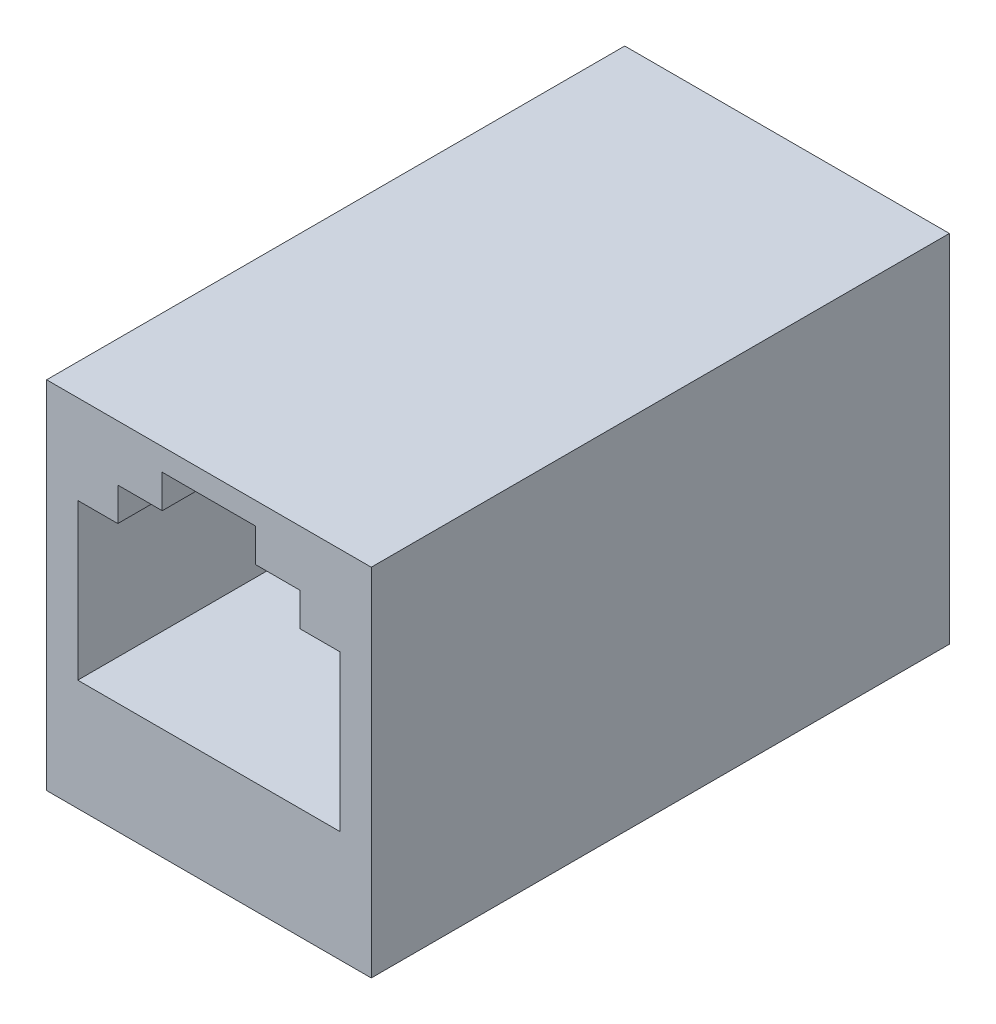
ISO-10303-21;
HEADER;
FILE_DESCRIPTION(('STEP AP214'),'2;1');
FILE_NAME('part.step','',(''),(''),'','','');
FILE_SCHEMA(('AUTOMOTIVE_DESIGN { 1 0 10303 214 1 1 1 1 }'));
ENDSEC;
DATA;
#1=APPLICATION_CONTEXT('core data for automotive mechanical design processes');
#2=APPLICATION_PROTOCOL_DEFINITION('international standard','automotive_design',2000,#1);
#3=PRODUCT_CONTEXT('',#1,'mechanical');
#4=PRODUCT('Part','Part','',(#3));
#5=PRODUCT_RELATED_PRODUCT_CATEGORY('part','',(#4));
#6=PRODUCT_DEFINITION_FORMATION('','',#4);
#7=PRODUCT_DEFINITION_CONTEXT('part definition',#1,'design');
#8=PRODUCT_DEFINITION('design','',#6,#7);
#9=PRODUCT_DEFINITION_SHAPE('','',#8);
#10=(LENGTH_UNIT() NAMED_UNIT(*) SI_UNIT(.MILLI.,.METRE.));
#11=(NAMED_UNIT(*) PLANE_ANGLE_UNIT() SI_UNIT($,.RADIAN.));
#12=(NAMED_UNIT(*) SI_UNIT($,.STERADIAN.) SOLID_ANGLE_UNIT());
#13=UNCERTAINTY_MEASURE_WITH_UNIT(LENGTH_MEASURE(1.E-05),#10,'distance_accuracy_value','');
#14=(GEOMETRIC_REPRESENTATION_CONTEXT(3) GLOBAL_UNCERTAINTY_ASSIGNED_CONTEXT((#13)) GLOBAL_UNIT_ASSIGNED_CONTEXT((#10,
#11,#12)) REPRESENTATION_CONTEXT('',''));
#15=CARTESIAN_POINT('',(0.,0.,0.));
#16=DIRECTION('',(0.,0.,1.));
#17=DIRECTION('',(1.,0.,0.));
#18=AXIS2_PLACEMENT_3D('',#15,#16,#17);
#19=CARTESIAN_POINT('',(-7.5,14.5,-13.));
#20=DIRECTION('',(0.,1.,0.));
#21=DIRECTION('',(-1.,0.,0.));
#22=AXIS2_PLACEMENT_3D('',#19,#20,#21);
#23=PLANE('',#22);
#24=DIRECTION('',(-1.,0.,0.));
#25=VECTOR('',#24,1.);
#26=CARTESIAN_POINT('',(-7.5,14.5,0.));
#27=LINE('',#26,#25);
#28=CARTESIAN_POINT('',(7.3,14.5,0.));
#29=VERTEX_POINT('',#28);
#30=CARTESIAN_POINT('',(-7.3,14.5,0.));
#31=VERTEX_POINT('',#30);
#32=EDGE_CURVE('E217',#29,#31,#27,.T.);
#33=ORIENTED_EDGE('',*,*,#32,.F.);
#34=DIRECTION('',(0.,0.,1.));
#35=VECTOR('',#34,1.);
#36=CARTESIAN_POINT('',(7.3,14.5,-26.));
#37=LINE('',#36,#35);
#38=CARTESIAN_POINT('',(7.3,14.5,-26.));
#39=VERTEX_POINT('',#38);
#40=EDGE_CURVE('E206',#39,#29,#37,.T.);
#41=ORIENTED_EDGE('',*,*,#40,.F.);
#42=DIRECTION('',(1.,0.,0.));
#43=VECTOR('',#42,1.);
#44=CARTESIAN_POINT('',(7.5,14.5,-26.));
#45=LINE('',#44,#43);
#46=CARTESIAN_POINT('',(-7.3,14.5,-26.));
#47=VERTEX_POINT('',#46);
#48=EDGE_CURVE('E216',#47,#39,#45,.T.);
#49=ORIENTED_EDGE('',*,*,#48,.F.);
#50=DIRECTION('',(0.,0.,1.));
#51=VECTOR('',#50,1.);
#52=CARTESIAN_POINT('',(-7.3,14.5,-26.));
#53=LINE('',#52,#51);
#54=EDGE_CURVE('E54',#47,#31,#53,.T.);
#55=ORIENTED_EDGE('',*,*,#54,.T.);
#56=EDGE_LOOP('',(#33,#41,#49,#55));
#57=FACE_BOUND('',#56,.T.);
#58=ADVANCED_FACE('F32',(#57),#23,.T.);
#59=CARTESIAN_POINT('',(-7.5,0.,0.));
#60=DIRECTION('',(0.,0.,1.));
#61=DIRECTION('',(1.,0.,0.));
#62=AXIS2_PLACEMENT_3D('',#59,#60,#61);
#63=PLANE('',#62);
#64=DIRECTION('',(0.,-1.,0.));
#65=VECTOR('',#64,1.);
#66=CARTESIAN_POINT('',(-2.1,12.,0.));
#67=LINE('',#66,#65);
#68=CARTESIAN_POINT('',(-2.1,13.5,0.));
#69=VERTEX_POINT('',#68);
#70=CARTESIAN_POINT('',(-2.1,12.,0.));
#71=VERTEX_POINT('',#70);
#72=EDGE_CURVE('E282',#69,#71,#67,.T.);
#73=ORIENTED_EDGE('',*,*,#72,.F.);
#74=DIRECTION('',(-1.,0.,0.));
#75=VECTOR('',#74,1.);
#76=CARTESIAN_POINT('',(-2.1,13.5,0.));
#77=LINE('',#76,#75);
#78=CARTESIAN_POINT('',(2.1,13.5,0.));
#79=VERTEX_POINT('',#78);
#80=EDGE_CURVE('E287',#79,#69,#77,.T.);
#81=ORIENTED_EDGE('',*,*,#80,.F.);
#82=DIRECTION('',(0.,1.,0.));
#83=VECTOR('',#82,1.);
#84=CARTESIAN_POINT('',(2.1,12.,0.));
#85=LINE('',#84,#83);
#86=CARTESIAN_POINT('',(2.1,12.,0.));
#87=VERTEX_POINT('',#86);
#88=EDGE_CURVE('E284',#87,#79,#85,.T.);
#89=ORIENTED_EDGE('',*,*,#88,.F.);
#90=DIRECTION('',(-1.,0.,0.));
#91=VECTOR('',#90,1.);
#92=CARTESIAN_POINT('',(-4.1,12.,0.));
#93=LINE('',#92,#91);
#94=CARTESIAN_POINT('',(4.1,12.,0.));
#95=VERTEX_POINT('',#94);
#96=EDGE_CURVE('E302',#95,#87,#93,.T.);
#97=ORIENTED_EDGE('',*,*,#96,.F.);
#98=DIRECTION('',(0.,1.,0.));
#99=VECTOR('',#98,1.);
#100=CARTESIAN_POINT('',(4.1,10.5,0.));
#101=LINE('',#100,#99);
#102=CARTESIAN_POINT('',(4.1,10.5,0.));
#103=VERTEX_POINT('',#102);
#104=EDGE_CURVE('E308',#103,#95,#101,.T.);
#105=ORIENTED_EDGE('',*,*,#104,.F.);
#106=DIRECTION('',(-1.,0.,0.));
#107=VECTOR('',#106,1.);
#108=CARTESIAN_POINT('',(-5.9,10.5,0.));
#109=LINE('',#108,#107);
#110=CARTESIAN_POINT('',(5.9,10.5,0.));
#111=VERTEX_POINT('',#110);
#112=EDGE_CURVE('E331',#111,#103,#109,.T.);
#113=ORIENTED_EDGE('',*,*,#112,.F.);
#114=DIRECTION('',(0.,1.,0.));
#115=VECTOR('',#114,1.);
#116=CARTESIAN_POINT('',(5.9,10.5,0.));
#117=LINE('',#116,#115);
#118=CARTESIAN_POINT('',(5.9,3.5,0.));
#119=VERTEX_POINT('',#118);
#120=EDGE_CURVE('E342',#119,#111,#117,.T.);
#121=ORIENTED_EDGE('',*,*,#120,.F.);
#122=DIRECTION('',(1.,0.,0.));
#123=VECTOR('',#122,1.);
#124=CARTESIAN_POINT('',(-5.9,3.5,0.));
#125=LINE('',#124,#123);
#126=CARTESIAN_POINT('',(-5.9,3.5,0.));
#127=VERTEX_POINT('',#126);
#128=EDGE_CURVE('E339',#127,#119,#125,.T.);
#129=ORIENTED_EDGE('',*,*,#128,.F.);
#130=DIRECTION('',(0.,-1.,0.));
#131=VECTOR('',#130,1.);
#132=CARTESIAN_POINT('',(-5.9,10.5,0.));
#133=LINE('',#132,#131);
#134=CARTESIAN_POINT('',(-5.9,10.5,0.));
#135=VERTEX_POINT('',#134);
#136=EDGE_CURVE('E327',#135,#127,#133,.T.);
#137=ORIENTED_EDGE('',*,*,#136,.F.);
#138=CARTESIAN_POINT('',(-4.1,10.5,0.));
#139=VERTEX_POINT('',#138);
#140=EDGE_CURVE('E345',#139,#135,#109,.T.);
#141=ORIENTED_EDGE('',*,*,#140,.F.);
#142=DIRECTION('',(0.,-1.,0.));
#143=VECTOR('',#142,1.);
#144=CARTESIAN_POINT('',(-4.1,10.5,0.));
#145=LINE('',#144,#143);
#146=CARTESIAN_POINT('',(-4.1,12.,0.));
#147=VERTEX_POINT('',#146);
#148=EDGE_CURVE('E298',#147,#139,#145,.T.);
#149=ORIENTED_EDGE('',*,*,#148,.F.);
#150=EDGE_CURVE('E311',#71,#147,#93,.T.);
#151=ORIENTED_EDGE('',*,*,#150,.F.);
#152=EDGE_LOOP('',(#73,#81,#89,#97,#105,#113,#121,#129,#137,#141,#149,#151));
#153=FACE_BOUND('',#152,.T.);
#154=DIRECTION('',(1.,0.,0.));
#155=VECTOR('',#154,1.);
#156=CARTESIAN_POINT('',(7.5,-1.5,0.));
#157=LINE('',#156,#155);
#158=CARTESIAN_POINT('',(-7.3,-1.5,0.));
#159=VERTEX_POINT('',#158);
#160=CARTESIAN_POINT('',(7.3,-1.5,0.));
#161=VERTEX_POINT('',#160);
#162=EDGE_CURVE('E221',#159,#161,#157,.T.);
#163=ORIENTED_EDGE('',*,*,#162,.T.);
#164=DIRECTION('',(0.,1.,0.));
#165=VECTOR('',#164,1.);
#166=CARTESIAN_POINT('',(7.3,14.5,0.));
#167=LINE('',#166,#165);
#168=EDGE_CURVE('E211',#161,#29,#167,.T.);
#169=ORIENTED_EDGE('',*,*,#168,.T.);
#170=ORIENTED_EDGE('',*,*,#32,.T.);
#171=DIRECTION('',(0.,1.,0.));
#172=VECTOR('',#171,1.);
#173=CARTESIAN_POINT('',(-7.3,14.5,0.));
#174=LINE('',#173,#172);
#175=EDGE_CURVE('E744',#159,#31,#174,.T.);
#176=ORIENTED_EDGE('',*,*,#175,.F.);
#177=EDGE_LOOP('',(#163,#169,#170,#176));
#178=FACE_BOUND('',#177,.T.);
#179=ADVANCED_FACE('F403',(#153,#178),#63,.T.);
#180=CARTESIAN_POINT('',(7.5,-1.5,-13.));
#181=DIRECTION('',(0.,-1.,0.));
#182=DIRECTION('',(1.,0.,0.));
#183=AXIS2_PLACEMENT_3D('',#180,#181,#182);
#184=PLANE('',#183);
#185=DIRECTION('',(-1.,0.,0.));
#186=VECTOR('',#185,1.);
#187=CARTESIAN_POINT('',(7.5,-1.5,-26.));
#188=LINE('',#187,#186);
#189=CARTESIAN_POINT('',(7.3,-1.5,-26.));
#190=VERTEX_POINT('',#189);
#191=CARTESIAN_POINT('',(-7.3,-1.5,-26.));
#192=VERTEX_POINT('',#191);
#193=EDGE_CURVE('E222',#190,#192,#188,.T.);
#194=ORIENTED_EDGE('',*,*,#193,.F.);
#195=DIRECTION('',(0.,0.,1.));
#196=VECTOR('',#195,1.);
#197=CARTESIAN_POINT('',(7.3,-1.5,-26.));
#198=LINE('',#197,#196);
#199=EDGE_CURVE('E46',#190,#161,#198,.T.);
#200=ORIENTED_EDGE('',*,*,#199,.T.);
#201=ORIENTED_EDGE('',*,*,#162,.F.);
#202=DIRECTION('',(0.,0.,1.));
#203=VECTOR('',#202,1.);
#204=CARTESIAN_POINT('',(-7.3,-1.5,-26.));
#205=LINE('',#204,#203);
#206=EDGE_CURVE('E746',#192,#159,#205,.T.);
#207=ORIENTED_EDGE('',*,*,#206,.F.);
#208=EDGE_LOOP('',(#194,#200,#201,#207));
#209=FACE_BOUND('',#208,.T.);
#210=ADVANCED_FACE('F494',(#209),#184,.T.);
#211=CARTESIAN_POINT('',(0.,0.,-26.));
#212=DIRECTION('',(0.,0.,-1.));
#213=DIRECTION('',(-1.,0.,0.));
#214=AXIS2_PLACEMENT_3D('',#211,#212,#213);
#215=PLANE('',#214);
#216=ORIENTED_EDGE('',*,*,#48,.T.);
#217=DIRECTION('',(0.,1.,0.));
#218=VECTOR('',#217,1.);
#219=CARTESIAN_POINT('',(7.3,14.5,-26.));
#220=LINE('',#219,#218);
#221=EDGE_CURVE('E203',#190,#39,#220,.T.);
#222=ORIENTED_EDGE('',*,*,#221,.F.);
#223=ORIENTED_EDGE('',*,*,#193,.T.);
#224=DIRECTION('',(0.,1.,0.));
#225=VECTOR('',#224,1.);
#226=CARTESIAN_POINT('',(-7.3,14.5,-26.));
#227=LINE('',#226,#225);
#228=EDGE_CURVE('E220',#192,#47,#227,.T.);
#229=ORIENTED_EDGE('',*,*,#228,.T.);
#230=EDGE_LOOP('',(#216,#222,#223,#229));
#231=FACE_BOUND('',#230,.T.);
#232=ADVANCED_FACE('F219',(#231),#215,.T.);
#233=CARTESIAN_POINT('',(-5.9,10.5,-12.));
#234=DIRECTION('',(-1.,0.,0.));
#235=DIRECTION('',(0.,-1.,0.));
#236=AXIS2_PLACEMENT_3D('',#233,#234,#235);
#237=PLANE('',#236);
#238=DIRECTION('',(0.,0.,-1.));
#239=VECTOR('',#238,1.);
#240=CARTESIAN_POINT('',(-5.9,9.5,-10.));
#241=LINE('',#240,#239);
#242=CARTESIAN_POINT('',(-5.9,9.5,-10.));
#243=VERTEX_POINT('',#242);
#244=CARTESIAN_POINT('',(-5.9,9.5,-12.));
#245=VERTEX_POINT('',#244);
#246=EDGE_CURVE('E266',#243,#245,#241,.T.);
#247=ORIENTED_EDGE('',*,*,#246,.F.);
#248=DIRECTION('',(0.,-1.,0.));
#249=VECTOR('',#248,1.);
#250=CARTESIAN_POINT('',(-5.9,10.5,-10.));
#251=LINE('',#250,#249);
#252=CARTESIAN_POINT('',(-5.9,10.5,-10.));
#253=VERTEX_POINT('',#252);
#254=EDGE_CURVE('E250',#253,#243,#251,.T.);
#255=ORIENTED_EDGE('',*,*,#254,.F.);
#256=DIRECTION('',(0.,0.,1.));
#257=VECTOR('',#256,1.);
#258=CARTESIAN_POINT('',(-5.9,10.5,-12.));
#259=LINE('',#258,#257);
#260=EDGE_CURVE('E348',#253,#135,#259,.T.);
#261=ORIENTED_EDGE('',*,*,#260,.T.);
#262=ORIENTED_EDGE('',*,*,#136,.T.);
#263=DIRECTION('',(0.,0.,1.));
#264=VECTOR('',#263,1.);
#265=CARTESIAN_POINT('',(-5.9,3.5,-12.));
#266=LINE('',#265,#264);
#267=CARTESIAN_POINT('',(-5.9,3.5,-12.));
#268=VERTEX_POINT('',#267);
#269=EDGE_CURVE('E337',#268,#127,#266,.T.);
#270=ORIENTED_EDGE('',*,*,#269,.F.);
#271=DIRECTION('',(0.,-1.,0.));
#272=VECTOR('',#271,1.);
#273=CARTESIAN_POINT('',(-5.9,10.5,-12.));
#274=LINE('',#273,#272);
#275=EDGE_CURVE('E328',#245,#268,#274,.T.);
#276=ORIENTED_EDGE('',*,*,#275,.F.);
#277=EDGE_LOOP('',(#247,#255,#261,#262,#270,#276));
#278=FACE_BOUND('',#277,.T.);
#279=ADVANCED_FACE('F452',(#278),#237,.F.);
#280=CARTESIAN_POINT('',(-5.9,3.5,-12.));
#281=DIRECTION('',(0.,0.,1.));
#282=DIRECTION('',(1.,0.,0.));
#283=AXIS2_PLACEMENT_3D('',#280,#281,#282);
#284=PLANE('',#283);
#285=DIRECTION('',(-1.,0.,0.));
#286=VECTOR('',#285,1.);
#287=CARTESIAN_POINT('',(5.9,9.5,-12.));
#288=LINE('',#287,#286);
#289=CARTESIAN_POINT('',(5.9,9.5,-12.));
#290=VERTEX_POINT('',#289);
#291=CARTESIAN_POINT('',(4.1,9.5,-12.));
#292=VERTEX_POINT('',#291);
#293=EDGE_CURVE('E225',#290,#292,#288,.T.);
#294=ORIENTED_EDGE('',*,*,#293,.T.);
#295=DIRECTION('',(0.,1.,0.));
#296=VECTOR('',#295,1.);
#297=CARTESIAN_POINT('',(4.1,10.5,-12.));
#298=LINE('',#297,#296);
#299=CARTESIAN_POINT('',(4.1,10.6,-12.));
#300=VERTEX_POINT('',#299);
#301=EDGE_CURVE('E301',#292,#300,#298,.T.);
#302=ORIENTED_EDGE('',*,*,#301,.T.);
#303=DIRECTION('',(1.,0.,0.));
#304=VECTOR('',#303,1.);
#305=CARTESIAN_POINT('',(-5.9,10.6,-12.));
#306=LINE('',#305,#304);
#307=CARTESIAN_POINT('',(-4.1,10.6,-12.));
#308=VERTEX_POINT('',#307);
#309=EDGE_CURVE('E275',#308,#300,#306,.T.);
#310=ORIENTED_EDGE('',*,*,#309,.F.);
#311=DIRECTION('',(0.,-1.,0.));
#312=VECTOR('',#311,1.);
#313=CARTESIAN_POINT('',(-4.1,10.5,-12.));
#314=LINE('',#313,#312);
#315=CARTESIAN_POINT('',(-4.1,9.5,-12.));
#316=VERTEX_POINT('',#315);
#317=EDGE_CURVE('E299',#308,#316,#314,.T.);
#318=ORIENTED_EDGE('',*,*,#317,.T.);
#319=DIRECTION('',(1.,0.,0.));
#320=VECTOR('',#319,1.);
#321=CARTESIAN_POINT('',(-5.9,9.5,-12.));
#322=LINE('',#321,#320);
#323=EDGE_CURVE('E249',#245,#316,#322,.T.);
#324=ORIENTED_EDGE('',*,*,#323,.F.);
#325=ORIENTED_EDGE('',*,*,#275,.T.);
#326=DIRECTION('',(1.,0.,0.));
#327=VECTOR('',#326,1.);
#328=CARTESIAN_POINT('',(-5.9,3.5,-12.));
#329=LINE('',#328,#327);
#330=CARTESIAN_POINT('',(5.9,3.5,-12.));
#331=VERTEX_POINT('',#330);
#332=EDGE_CURVE('E330',#268,#331,#329,.T.);
#333=ORIENTED_EDGE('',*,*,#332,.T.);
#334=DIRECTION('',(0.,1.,0.));
#335=VECTOR('',#334,1.);
#336=CARTESIAN_POINT('',(5.9,10.5,-12.));
#337=LINE('',#336,#335);
#338=EDGE_CURVE('E334',#331,#290,#337,.T.);
#339=ORIENTED_EDGE('',*,*,#338,.T.);
#340=EDGE_LOOP('',(#294,#302,#310,#318,#324,#325,#333,#339));
#341=FACE_BOUND('',#340,.T.);
#342=ADVANCED_FACE('F463',(#341),#284,.T.);
#343=CARTESIAN_POINT('',(6.5,11.5,-3.));
#344=DIRECTION('',(0.,0.,-1.));
#345=DIRECTION('',(-1.,0.,0.));
#346=AXIS2_PLACEMENT_3D('',#343,#344,#345);
#347=PLANE('',#346);
#348=DIRECTION('',(0.,1.,0.));
#349=VECTOR('',#348,1.);
#350=CARTESIAN_POINT('',(-2.1,11.5,-3.));
#351=LINE('',#350,#349);
#352=CARTESIAN_POINT('',(-2.1,12.,-3.));
#353=VERTEX_POINT('',#352);
#354=CARTESIAN_POINT('',(-2.1,13.5,-3.));
#355=VERTEX_POINT('',#354);
#356=EDGE_CURVE('E296',#353,#355,#351,.T.);
#357=ORIENTED_EDGE('',*,*,#356,.F.);
#358=DIRECTION('',(1.,0.,0.));
#359=VECTOR('',#358,1.);
#360=CARTESIAN_POINT('',(6.5,12.,-3.));
#361=LINE('',#360,#359);
#362=CARTESIAN_POINT('',(-4.1,12.,-3.));
#363=VERTEX_POINT('',#362);
#364=EDGE_CURVE('E387',#363,#353,#361,.T.);
#365=ORIENTED_EDGE('',*,*,#364,.F.);
#366=DIRECTION('',(0.,1.,0.));
#367=VECTOR('',#366,1.);
#368=CARTESIAN_POINT('',(-4.1,11.5,-3.));
#369=LINE('',#368,#367);
#370=CARTESIAN_POINT('',(-4.1,11.5,-3.));
#371=VERTEX_POINT('',#370);
#372=EDGE_CURVE('E325',#371,#363,#369,.T.);
#373=ORIENTED_EDGE('',*,*,#372,.F.);
#374=DIRECTION('',(-1.,0.,0.));
#375=VECTOR('',#374,1.);
#376=CARTESIAN_POINT('',(6.5,11.5,-3.));
#377=LINE('',#376,#375);
#378=CARTESIAN_POINT('',(-6.5,11.5,-3.));
#379=VERTEX_POINT('',#378);
#380=EDGE_CURVE('E360',#371,#379,#377,.T.);
#381=ORIENTED_EDGE('',*,*,#380,.T.);
#382=DIRECTION('',(0.,1.,0.));
#383=VECTOR('',#382,1.);
#384=CARTESIAN_POINT('',(-6.5,13.5,-3.));
#385=LINE('',#384,#383);
#386=CARTESIAN_POINT('',(-6.5,13.5,-3.));
#387=VERTEX_POINT('',#386);
#388=EDGE_CURVE('E365',#379,#387,#385,.T.);
#389=ORIENTED_EDGE('',*,*,#388,.T.);
#390=DIRECTION('',(1.,0.,0.));
#391=VECTOR('',#390,1.);
#392=CARTESIAN_POINT('',(6.5,13.5,-3.));
#393=LINE('',#392,#391);
#394=EDGE_CURVE('E369',#387,#355,#393,.T.);
#395=ORIENTED_EDGE('',*,*,#394,.T.);
#396=EDGE_LOOP('',(#357,#365,#373,#381,#389,#395));
#397=FACE_BOUND('',#396,.T.);
#398=ADVANCED_FACE('F416',(#397),#347,.T.);
#399=CARTESIAN_POINT('',(-4.1,12.,-12.));
#400=DIRECTION('',(0.,1.,0.));
#401=DIRECTION('',(0.,0.,1.));
#402=AXIS2_PLACEMENT_3D('',#399,#400,#401);
#403=PLANE('',#402);
#404=ORIENTED_EDGE('',*,*,#364,.T.);
#405=DIRECTION('',(0.,0.,1.));
#406=VECTOR('',#405,1.);
#407=CARTESIAN_POINT('',(-2.1,12.,-12.));
#408=LINE('',#407,#406);
#409=EDGE_CURVE('E39',#353,#71,#408,.T.);
#410=ORIENTED_EDGE('',*,*,#409,.T.);
#411=ORIENTED_EDGE('',*,*,#150,.T.);
#412=DIRECTION('',(0.,0.,1.));
#413=VECTOR('',#412,1.);
#414=CARTESIAN_POINT('',(-4.1,12.,-12.));
#415=LINE('',#414,#413);
#416=EDGE_CURVE('E314',#363,#147,#415,.T.);
#417=ORIENTED_EDGE('',*,*,#416,.F.);
#418=EDGE_LOOP('',(#404,#410,#411,#417));
#419=FACE_BOUND('',#418,.T.);
#420=ADVANCED_FACE('F395',(#419),#403,.F.);
#421=CARTESIAN_POINT('',(-5.9,10.5,-12.));
#422=DIRECTION('',(0.,1.,0.));
#423=DIRECTION('',(0.,0.,1.));
#424=AXIS2_PLACEMENT_3D('',#421,#422,#423);
#425=PLANE('',#424);
#426=ORIENTED_EDGE('',*,*,#260,.F.);
#427=DIRECTION('',(-1.,0.,0.));
#428=VECTOR('',#427,1.);
#429=CARTESIAN_POINT('',(-5.9,10.5,-10.));
#430=LINE('',#429,#428);
#431=CARTESIAN_POINT('',(-4.1,10.5,-10.));
#432=VERTEX_POINT('',#431);
#433=EDGE_CURVE('E258',#432,#253,#430,.T.);
#434=ORIENTED_EDGE('',*,*,#433,.F.);
#435=DIRECTION('',(0.,0.,1.));
#436=VECTOR('',#435,1.);
#437=CARTESIAN_POINT('',(-4.1,10.5,-12.));
#438=LINE('',#437,#436);
#439=EDGE_CURVE('E305',#432,#139,#438,.T.);
#440=ORIENTED_EDGE('',*,*,#439,.T.);
#441=ORIENTED_EDGE('',*,*,#140,.T.);
#442=EDGE_LOOP('',(#426,#434,#440,#441));
#443=FACE_BOUND('',#442,.T.);
#444=ADVANCED_FACE('F455',(#443),#425,.F.);
#445=CARTESIAN_POINT('',(6.5,13.5,-3.));
#446=DIRECTION('',(1.,0.,0.));
#447=DIRECTION('',(0.,1.,0.));
#448=AXIS2_PLACEMENT_3D('',#445,#446,#447);
#449=PLANE('',#448);
#450=DIRECTION('',(0.,-1.,0.));
#451=VECTOR('',#450,1.);
#452=CARTESIAN_POINT('',(6.5,13.5,-13.));
#453=LINE('',#452,#451);
#454=CARTESIAN_POINT('',(6.5,13.5,-13.));
#455=VERTEX_POINT('',#454);
#456=CARTESIAN_POINT('',(6.5,10.5,-13.));
#457=VERTEX_POINT('',#456);
#458=EDGE_CURVE('E350',#455,#457,#453,.T.);
#459=ORIENTED_EDGE('',*,*,#458,.T.);
#460=DIRECTION('',(0.,0.0995037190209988,0.995037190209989));
#461=VECTOR('',#460,1.);
#462=CARTESIAN_POINT('',(6.5,11.5,-3.));
#463=LINE('',#462,#461);
#464=CARTESIAN_POINT('',(6.5,11.5,-3.));
#465=VERTEX_POINT('',#464);
#466=EDGE_CURVE('E272',#457,#465,#463,.T.);
#467=ORIENTED_EDGE('',*,*,#466,.T.);
#468=DIRECTION('',(0.,-1.,0.));
#469=VECTOR('',#468,1.);
#470=CARTESIAN_POINT('',(6.5,13.5,-3.));
#471=LINE('',#470,#469);
#472=CARTESIAN_POINT('',(6.5,13.5,-3.));
#473=VERTEX_POINT('',#472);
#474=EDGE_CURVE('E357',#473,#465,#471,.T.);
#475=ORIENTED_EDGE('',*,*,#474,.F.);
#476=DIRECTION('',(0.,0.,-1.));
#477=VECTOR('',#476,1.);
#478=CARTESIAN_POINT('',(6.5,13.5,-3.));
#479=LINE('',#478,#477);
#480=EDGE_CURVE('E380',#473,#455,#479,.T.);
#481=ORIENTED_EDGE('',*,*,#480,.T.);
#482=EDGE_LOOP('',(#459,#467,#475,#481));
#483=FACE_BOUND('',#482,.T.);
#484=ADVANCED_FACE('F473',(#483),#449,.F.);
#485=CARTESIAN_POINT('',(6.5,13.5,-3.));
#486=DIRECTION('',(0.,1.,0.));
#487=DIRECTION('',(0.,0.,1.));
#488=AXIS2_PLACEMENT_3D('',#485,#486,#487);
#489=PLANE('',#488);
#490=CARTESIAN_POINT('',(2.1,13.5,-3.));
#491=VERTEX_POINT('',#490);
#492=EDGE_CURVE('E368',#491,#473,#393,.T.);
#493=ORIENTED_EDGE('',*,*,#492,.F.);
#494=DIRECTION('',(0.,0.,1.));
#495=VECTOR('',#494,1.);
#496=CARTESIAN_POINT('',(2.1,13.5,-17.4598206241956));
#497=LINE('',#496,#495);
#498=EDGE_CURVE('E290',#491,#79,#497,.T.);
#499=ORIENTED_EDGE('',*,*,#498,.T.);
#500=ORIENTED_EDGE('',*,*,#80,.T.);
#501=DIRECTION('',(0.,0.,1.));
#502=VECTOR('',#501,1.);
#503=CARTESIAN_POINT('',(-2.1,13.5,-17.4598206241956));
#504=LINE('',#503,#502);
#505=EDGE_CURVE('E291',#355,#69,#504,.T.);
#506=ORIENTED_EDGE('',*,*,#505,.F.);
#507=ORIENTED_EDGE('',*,*,#394,.F.);
#508=DIRECTION('',(0.,0.,-1.));
#509=VECTOR('',#508,1.);
#510=CARTESIAN_POINT('',(-6.5,13.5,-3.));
#511=LINE('',#510,#509);
#512=CARTESIAN_POINT('',(-6.5,13.5,-13.));
#513=VERTEX_POINT('',#512);
#514=EDGE_CURVE('E372',#387,#513,#511,.T.);
#515=ORIENTED_EDGE('',*,*,#514,.T.);
#516=DIRECTION('',(1.,0.,0.));
#517=VECTOR('',#516,1.);
#518=CARTESIAN_POINT('',(6.5,13.5,-13.));
#519=LINE('',#518,#517);
#520=EDGE_CURVE('E361',#513,#455,#519,.T.);
#521=ORIENTED_EDGE('',*,*,#520,.T.);
#522=ORIENTED_EDGE('',*,*,#480,.F.);
#523=EDGE_LOOP('',(#493,#499,#500,#506,#507,#515,#521,#522));
#524=FACE_BOUND('',#523,.T.);
#525=ADVANCED_FACE('F423',(#524),#489,.F.);
#526=CARTESIAN_POINT('',(-6.5,13.5,-3.));
#527=DIRECTION('',(-1.,0.,0.));
#528=DIRECTION('',(0.,0.,1.));
#529=AXIS2_PLACEMENT_3D('',#526,#527,#528);
#530=PLANE('',#529);
#531=DIRECTION('',(0.,1.,0.));
#532=VECTOR('',#531,1.);
#533=CARTESIAN_POINT('',(-6.5,13.5,-13.));
#534=LINE('',#533,#532);
#535=CARTESIAN_POINT('',(-6.5,10.5,-13.));
#536=VERTEX_POINT('',#535);
#537=EDGE_CURVE('E375',#536,#513,#534,.T.);
#538=ORIENTED_EDGE('',*,*,#537,.T.);
#539=ORIENTED_EDGE('',*,*,#514,.F.);
#540=ORIENTED_EDGE('',*,*,#388,.F.);
#541=DIRECTION('',(0.,0.0995037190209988,0.995037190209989));
#542=VECTOR('',#541,1.);
#543=CARTESIAN_POINT('',(-6.5,11.5,-3.));
#544=LINE('',#543,#542);
#545=EDGE_CURVE('E269',#536,#379,#544,.T.);
#546=ORIENTED_EDGE('',*,*,#545,.F.);
#547=EDGE_LOOP('',(#538,#539,#540,#546));
#548=FACE_BOUND('',#547,.T.);
#549=ADVANCED_FACE('F480',(#548),#530,.F.);
#550=DIRECTION('',(0.,-1.,0.));
#551=VECTOR('',#550,1.);
#552=CARTESIAN_POINT('',(2.1,11.5,-3.));
#553=LINE('',#552,#551);
#554=CARTESIAN_POINT('',(2.1,12.,-3.));
#555=VERTEX_POINT('',#554);
#556=EDGE_CURVE('E293',#491,#555,#553,.T.);
#557=ORIENTED_EDGE('',*,*,#556,.F.);
#558=ORIENTED_EDGE('',*,*,#492,.T.);
#559=ORIENTED_EDGE('',*,*,#474,.T.);
#560=CARTESIAN_POINT('',(4.1,11.5,-3.));
#561=VERTEX_POINT('',#560);
#562=EDGE_CURVE('E362',#465,#561,#377,.T.);
#563=ORIENTED_EDGE('',*,*,#562,.T.);
#564=DIRECTION('',(0.,-1.,0.));
#565=VECTOR('',#564,1.);
#566=CARTESIAN_POINT('',(4.1,11.5,-3.));
#567=LINE('',#566,#565);
#568=CARTESIAN_POINT('',(4.1,12.,-3.));
#569=VERTEX_POINT('',#568);
#570=EDGE_CURVE('E317',#569,#561,#567,.T.);
#571=ORIENTED_EDGE('',*,*,#570,.F.);
#572=EDGE_CURVE('E386',#555,#569,#361,.T.);
#573=ORIENTED_EDGE('',*,*,#572,.F.);
#574=EDGE_LOOP('',(#557,#558,#559,#563,#571,#573));
#575=FACE_BOUND('',#574,.T.);
#576=ADVANCED_FACE('F469',(#575),#347,.T.);
#577=DIRECTION('',(0.,0.,1.));
#578=VECTOR('',#577,1.);
#579=CARTESIAN_POINT('',(4.1,10.5,-12.));
#580=LINE('',#579,#578);
#581=CARTESIAN_POINT('',(4.1,10.5,-10.));
#582=VERTEX_POINT('',#581);
#583=EDGE_CURVE('E320',#582,#103,#580,.T.);
#584=ORIENTED_EDGE('',*,*,#583,.F.);
#585=DIRECTION('',(1.,0.,0.));
#586=VECTOR('',#585,1.);
#587=CARTESIAN_POINT('',(5.9,10.5,-10.));
#588=LINE('',#587,#586);
#589=CARTESIAN_POINT('',(5.9,10.5,-10.));
#590=VERTEX_POINT('',#589);
#591=EDGE_CURVE('E233',#582,#590,#588,.T.);
#592=ORIENTED_EDGE('',*,*,#591,.T.);
#593=DIRECTION('',(0.,0.,1.));
#594=VECTOR('',#593,1.);
#595=CARTESIAN_POINT('',(5.9,10.5,-12.));
#596=LINE('',#595,#594);
#597=EDGE_CURVE('E351',#590,#111,#596,.T.);
#598=ORIENTED_EDGE('',*,*,#597,.T.);
#599=ORIENTED_EDGE('',*,*,#112,.T.);
#600=EDGE_LOOP('',(#584,#592,#598,#599));
#601=FACE_BOUND('',#600,.T.);
#602=ADVANCED_FACE('F439',(#601),#425,.F.);
#603=CARTESIAN_POINT('',(5.9,10.5,-12.));
#604=DIRECTION('',(1.,0.,0.));
#605=DIRECTION('',(0.,1.,0.));
#606=AXIS2_PLACEMENT_3D('',#603,#604,#605);
#607=PLANE('',#606);
#608=DIRECTION('',(0.,-1.,0.));
#609=VECTOR('',#608,1.);
#610=CARTESIAN_POINT('',(5.9,10.5,-10.));
#611=LINE('',#610,#609);
#612=CARTESIAN_POINT('',(5.9,9.5,-10.));
#613=VERTEX_POINT('',#612);
#614=EDGE_CURVE('E230',#590,#613,#611,.T.);
#615=ORIENTED_EDGE('',*,*,#614,.T.);
#616=DIRECTION('',(0.,0.,-1.));
#617=VECTOR('',#616,1.);
#618=CARTESIAN_POINT('',(5.9,9.5,-10.));
#619=LINE('',#618,#617);
#620=EDGE_CURVE('E241',#613,#290,#619,.T.);
#621=ORIENTED_EDGE('',*,*,#620,.T.);
#622=ORIENTED_EDGE('',*,*,#338,.F.);
#623=DIRECTION('',(0.,0.,1.));
#624=VECTOR('',#623,1.);
#625=CARTESIAN_POINT('',(5.9,3.5,-12.));
#626=LINE('',#625,#624);
#627=EDGE_CURVE('E353',#331,#119,#626,.T.);
#628=ORIENTED_EDGE('',*,*,#627,.T.);
#629=ORIENTED_EDGE('',*,*,#120,.T.);
#630=ORIENTED_EDGE('',*,*,#597,.F.);
#631=EDGE_LOOP('',(#615,#621,#622,#628,#629,#630));
#632=FACE_BOUND('',#631,.T.);
#633=ADVANCED_FACE('F443',(#632),#607,.F.);
#634=CARTESIAN_POINT('',(-5.9,3.5,-12.));
#635=DIRECTION('',(0.,-1.,0.));
#636=DIRECTION('',(0.,0.,-1.));
#637=AXIS2_PLACEMENT_3D('',#634,#635,#636);
#638=PLANE('',#637);
#639=ORIENTED_EDGE('',*,*,#128,.T.);
#640=ORIENTED_EDGE('',*,*,#627,.F.);
#641=ORIENTED_EDGE('',*,*,#332,.F.);
#642=ORIENTED_EDGE('',*,*,#269,.T.);
#643=EDGE_LOOP('',(#639,#640,#641,#642));
#644=FACE_BOUND('',#643,.T.);
#645=ADVANCED_FACE('F447',(#644),#638,.F.);
#646=CARTESIAN_POINT('',(-4.1,10.5,-12.));
#647=DIRECTION('',(-1.,0.,0.));
#648=DIRECTION('',(0.,0.,1.));
#649=AXIS2_PLACEMENT_3D('',#646,#647,#648);
#650=PLANE('',#649);
#651=ORIENTED_EDGE('',*,*,#317,.F.);
#652=DIRECTION('',(0.,0.0995037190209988,0.995037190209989));
#653=VECTOR('',#652,1.);
#654=CARTESIAN_POINT('',(-4.1,10.5990099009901,-12.009900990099));
#655=LINE('',#654,#653);
#656=EDGE_CURVE('E279',#308,#371,#655,.T.);
#657=ORIENTED_EDGE('',*,*,#656,.T.);
#658=ORIENTED_EDGE('',*,*,#372,.T.);
#659=ORIENTED_EDGE('',*,*,#416,.T.);
#660=ORIENTED_EDGE('',*,*,#148,.T.);
#661=ORIENTED_EDGE('',*,*,#439,.F.);
#662=DIRECTION('',(0.,1.,0.));
#663=VECTOR('',#662,1.);
#664=CARTESIAN_POINT('',(-4.1,10.5,-10.));
#665=LINE('',#664,#663);
#666=CARTESIAN_POINT('',(-4.1,9.5,-10.));
#667=VERTEX_POINT('',#666);
#668=EDGE_CURVE('E255',#667,#432,#665,.T.);
#669=ORIENTED_EDGE('',*,*,#668,.F.);
#670=DIRECTION('',(0.,0.,-1.));
#671=VECTOR('',#670,1.);
#672=CARTESIAN_POINT('',(-4.1,9.5,-10.));
#673=LINE('',#672,#671);
#674=EDGE_CURVE('E261',#667,#316,#673,.T.);
#675=ORIENTED_EDGE('',*,*,#674,.T.);
#676=EDGE_LOOP('',(#651,#657,#658,#659,#660,#661,#669,#675));
#677=FACE_BOUND('',#676,.T.);
#678=ADVANCED_FACE('F411',(#677),#650,.F.);
#679=CARTESIAN_POINT('',(4.1,10.5,-12.));
#680=DIRECTION('',(1.,0.,0.));
#681=DIRECTION('',(0.,0.,-1.));
#682=AXIS2_PLACEMENT_3D('',#679,#680,#681);
#683=PLANE('',#682);
#684=ORIENTED_EDGE('',*,*,#570,.T.);
#685=DIRECTION('',(0.,-0.0995037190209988,-0.995037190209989));
#686=VECTOR('',#685,1.);
#687=CARTESIAN_POINT('',(4.1,10.5990099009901,-12.009900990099));
#688=LINE('',#687,#686);
#689=EDGE_CURVE('E11',#561,#300,#688,.T.);
#690=ORIENTED_EDGE('',*,*,#689,.T.);
#691=ORIENTED_EDGE('',*,*,#301,.F.);
#692=DIRECTION('',(0.,0.,-1.));
#693=VECTOR('',#692,1.);
#694=CARTESIAN_POINT('',(4.1,9.5,-10.));
#695=LINE('',#694,#693);
#696=CARTESIAN_POINT('',(4.1,9.5,-10.));
#697=VERTEX_POINT('',#696);
#698=EDGE_CURVE('E246',#697,#292,#695,.T.);
#699=ORIENTED_EDGE('',*,*,#698,.F.);
#700=DIRECTION('',(0.,1.,0.));
#701=VECTOR('',#700,1.);
#702=CARTESIAN_POINT('',(4.1,10.5,-10.));
#703=LINE('',#702,#701);
#704=EDGE_CURVE('E236',#697,#582,#703,.T.);
#705=ORIENTED_EDGE('',*,*,#704,.T.);
#706=ORIENTED_EDGE('',*,*,#583,.T.);
#707=ORIENTED_EDGE('',*,*,#104,.T.);
#708=DIRECTION('',(0.,0.,1.));
#709=VECTOR('',#708,1.);
#710=CARTESIAN_POINT('',(4.1,12.,-12.));
#711=LINE('',#710,#709);
#712=EDGE_CURVE('E318',#569,#95,#711,.T.);
#713=ORIENTED_EDGE('',*,*,#712,.F.);
#714=EDGE_LOOP('',(#684,#690,#691,#699,#705,#706,#707,#713));
#715=FACE_BOUND('',#714,.T.);
#716=ADVANCED_FACE('F434',(#715),#683,.F.);
#717=ORIENTED_EDGE('',*,*,#96,.T.);
#718=DIRECTION('',(0.,0.,-1.));
#719=VECTOR('',#718,1.);
#720=CARTESIAN_POINT('',(2.1,12.,-12.));
#721=LINE('',#720,#719);
#722=EDGE_CURVE('E390',#87,#555,#721,.T.);
#723=ORIENTED_EDGE('',*,*,#722,.T.);
#724=ORIENTED_EDGE('',*,*,#572,.T.);
#725=ORIENTED_EDGE('',*,*,#712,.T.);
#726=EDGE_LOOP('',(#717,#723,#724,#725));
#727=FACE_BOUND('',#726,.T.);
#728=ADVANCED_FACE('F429',(#727),#403,.F.);
#729=CARTESIAN_POINT('',(-2.1,12.,-17.4598206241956));
#730=DIRECTION('',(-1.,0.,0.));
#731=DIRECTION('',(0.,0.,1.));
#732=AXIS2_PLACEMENT_3D('',#729,#730,#731);
#733=PLANE('',#732);
#734=ORIENTED_EDGE('',*,*,#356,.T.);
#735=ORIENTED_EDGE('',*,*,#505,.T.);
#736=ORIENTED_EDGE('',*,*,#72,.T.);
#737=ORIENTED_EDGE('',*,*,#409,.F.);
#738=EDGE_LOOP('',(#734,#735,#736,#737));
#739=FACE_BOUND('',#738,.T.);
#740=ADVANCED_FACE('F420',(#739),#733,.F.);
#741=CARTESIAN_POINT('',(2.1,12.,-17.4598206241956));
#742=DIRECTION('',(1.,0.,0.));
#743=DIRECTION('',(0.,0.,-1.));
#744=AXIS2_PLACEMENT_3D('',#741,#742,#743);
#745=PLANE('',#744);
#746=ORIENTED_EDGE('',*,*,#556,.T.);
#747=ORIENTED_EDGE('',*,*,#722,.F.);
#748=ORIENTED_EDGE('',*,*,#88,.T.);
#749=ORIENTED_EDGE('',*,*,#498,.F.);
#750=EDGE_LOOP('',(#746,#747,#748,#749));
#751=FACE_BOUND('',#750,.T.);
#752=ADVANCED_FACE('F548',(#751),#745,.F.);
#753=CARTESIAN_POINT('',(16.5498756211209,11.5,-3.));
#754=DIRECTION('',(0.,-0.995037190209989,0.0995037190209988));
#755=DIRECTION('',(0.,-0.0995037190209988,-0.995037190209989));
#756=AXIS2_PLACEMENT_3D('',#753,#754,#755);
#757=PLANE('',#756);
#758=ORIENTED_EDGE('',*,*,#309,.T.);
#759=ORIENTED_EDGE('',*,*,#689,.F.);
#760=ORIENTED_EDGE('',*,*,#562,.F.);
#761=ORIENTED_EDGE('',*,*,#466,.F.);
#762=DIRECTION('',(-1.,0.,0.));
#763=VECTOR('',#762,1.);
#764=CARTESIAN_POINT('',(16.5498756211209,10.5,-13.));
#765=LINE('',#764,#763);
#766=EDGE_CURVE('E271',#457,#536,#765,.T.);
#767=ORIENTED_EDGE('',*,*,#766,.T.);
#768=ORIENTED_EDGE('',*,*,#545,.T.);
#769=ORIENTED_EDGE('',*,*,#380,.F.);
#770=ORIENTED_EDGE('',*,*,#656,.F.);
#771=EDGE_LOOP('',(#758,#759,#760,#761,#767,#768,#769,#770));
#772=FACE_BOUND('',#771,.T.);
#773=ADVANCED_FACE('F466',(#772),#757,.F.);
#774=CARTESIAN_POINT('',(-5.9,9.5,-10.));
#775=DIRECTION('',(0.,1.,0.));
#776=DIRECTION('',(0.,0.,1.));
#777=AXIS2_PLACEMENT_3D('',#774,#775,#776);
#778=PLANE('',#777);
#779=ORIENTED_EDGE('',*,*,#323,.T.);
#780=ORIENTED_EDGE('',*,*,#674,.F.);
#781=DIRECTION('',(1.,0.,0.));
#782=VECTOR('',#781,1.);
#783=CARTESIAN_POINT('',(-5.9,9.5,-10.));
#784=LINE('',#783,#782);
#785=EDGE_CURVE('E253',#243,#667,#784,.T.);
#786=ORIENTED_EDGE('',*,*,#785,.F.);
#787=ORIENTED_EDGE('',*,*,#246,.T.);
#788=EDGE_LOOP('',(#779,#780,#786,#787));
#789=FACE_BOUND('',#788,.T.);
#790=ADVANCED_FACE('F461',(#789),#778,.F.);
#791=CARTESIAN_POINT('',(-5.9,9.5,-10.));
#792=DIRECTION('',(0.,0.,1.));
#793=DIRECTION('',(1.,0.,0.));
#794=AXIS2_PLACEMENT_3D('',#791,#792,#793);
#795=PLANE('',#794);
#796=ORIENTED_EDGE('',*,*,#254,.T.);
#797=ORIENTED_EDGE('',*,*,#785,.T.);
#798=ORIENTED_EDGE('',*,*,#668,.T.);
#799=ORIENTED_EDGE('',*,*,#433,.T.);
#800=EDGE_LOOP('',(#796,#797,#798,#799));
#801=FACE_BOUND('',#800,.T.);
#802=ADVANCED_FACE('F457',(#801),#795,.T.);
#803=CARTESIAN_POINT('',(5.9,9.5,-10.));
#804=DIRECTION('',(0.,-1.,0.));
#805=DIRECTION('',(0.,0.,-1.));
#806=AXIS2_PLACEMENT_3D('',#803,#804,#805);
#807=PLANE('',#806);
#808=ORIENTED_EDGE('',*,*,#293,.F.);
#809=ORIENTED_EDGE('',*,*,#620,.F.);
#810=DIRECTION('',(-1.,0.,0.));
#811=VECTOR('',#810,1.);
#812=CARTESIAN_POINT('',(5.9,9.5,-10.));
#813=LINE('',#812,#811);
#814=EDGE_CURVE('E238',#613,#697,#813,.T.);
#815=ORIENTED_EDGE('',*,*,#814,.T.);
#816=ORIENTED_EDGE('',*,*,#698,.T.);
#817=EDGE_LOOP('',(#808,#809,#815,#816));
#818=FACE_BOUND('',#817,.T.);
#819=ADVANCED_FACE('F537',(#818),#807,.T.);
#820=CARTESIAN_POINT('',(5.9,9.5,-10.));
#821=DIRECTION('',(0.,0.,1.));
#822=DIRECTION('',(-1.,0.,0.));
#823=AXIS2_PLACEMENT_3D('',#820,#821,#822);
#824=PLANE('',#823);
#825=ORIENTED_EDGE('',*,*,#614,.F.);
#826=ORIENTED_EDGE('',*,*,#591,.F.);
#827=ORIENTED_EDGE('',*,*,#704,.F.);
#828=ORIENTED_EDGE('',*,*,#814,.F.);
#829=EDGE_LOOP('',(#825,#826,#827,#828));
#830=FACE_BOUND('',#829,.T.);
#831=ADVANCED_FACE('F533',(#830),#824,.T.);
#832=CARTESIAN_POINT('',(0.,0.,-13.));
#833=DIRECTION('',(0.,0.,-1.));
#834=DIRECTION('',(-1.,0.,0.));
#835=AXIS2_PLACEMENT_3D('',#832,#833,#834);
#836=PLANE('',#835);
#837=ORIENTED_EDGE('',*,*,#766,.F.);
#838=ORIENTED_EDGE('',*,*,#458,.F.);
#839=ORIENTED_EDGE('',*,*,#520,.F.);
#840=ORIENTED_EDGE('',*,*,#537,.F.);
#841=EDGE_LOOP('',(#837,#838,#839,#840));
#842=FACE_BOUND('',#841,.T.);
#843=ADVANCED_FACE('F476',(#842),#836,.F.);
#844=CARTESIAN_POINT('',(-7.3,14.5,-26.));
#845=DIRECTION('',(1.,0.,0.));
#846=DIRECTION('',(0.,1.,0.));
#847=AXIS2_PLACEMENT_3D('',#844,#845,#846);
#848=PLANE('',#847);
#849=ORIENTED_EDGE('',*,*,#175,.T.);
#850=ORIENTED_EDGE('',*,*,#54,.F.);
#851=ORIENTED_EDGE('',*,*,#228,.F.);
#852=ORIENTED_EDGE('',*,*,#206,.T.);
#853=EDGE_LOOP('',(#849,#850,#851,#852));
#854=FACE_BOUND('',#853,.T.);
#855=ADVANCED_FACE('F530',(#854),#848,.F.);
#856=CARTESIAN_POINT('',(7.3,14.5,-26.));
#857=DIRECTION('',(1.,0.,0.));
#858=DIRECTION('',(0.,1.,0.));
#859=AXIS2_PLACEMENT_3D('',#856,#857,#858);
#860=PLANE('',#859);
#861=ORIENTED_EDGE('',*,*,#168,.F.);
#862=ORIENTED_EDGE('',*,*,#199,.F.);
#863=ORIENTED_EDGE('',*,*,#221,.T.);
#864=ORIENTED_EDGE('',*,*,#40,.T.);
#865=EDGE_LOOP('',(#861,#862,#863,#864));
#866=FACE_BOUND('',#865,.T.);
#867=ADVANCED_FACE('F205',(#866),#860,.T.);
#868=CLOSED_SHELL('',(#58,#179,#210,#232,#279,#342,#398,#420,#444,#484,#525,#549,#576,#602,#633,
#645,#678,#716,#728,#740,#752,#773,#790,#802,#819,#831,#843,#855,#867));
#869=MANIFOLD_SOLID_BREP('B2',#868);
#870=ADVANCED_BREP_SHAPE_REPRESENTATION('',(#18,#869),#14);
#871=SHAPE_DEFINITION_REPRESENTATION(#9,#870);
ENDSEC;
END-ISO-10303-21;
